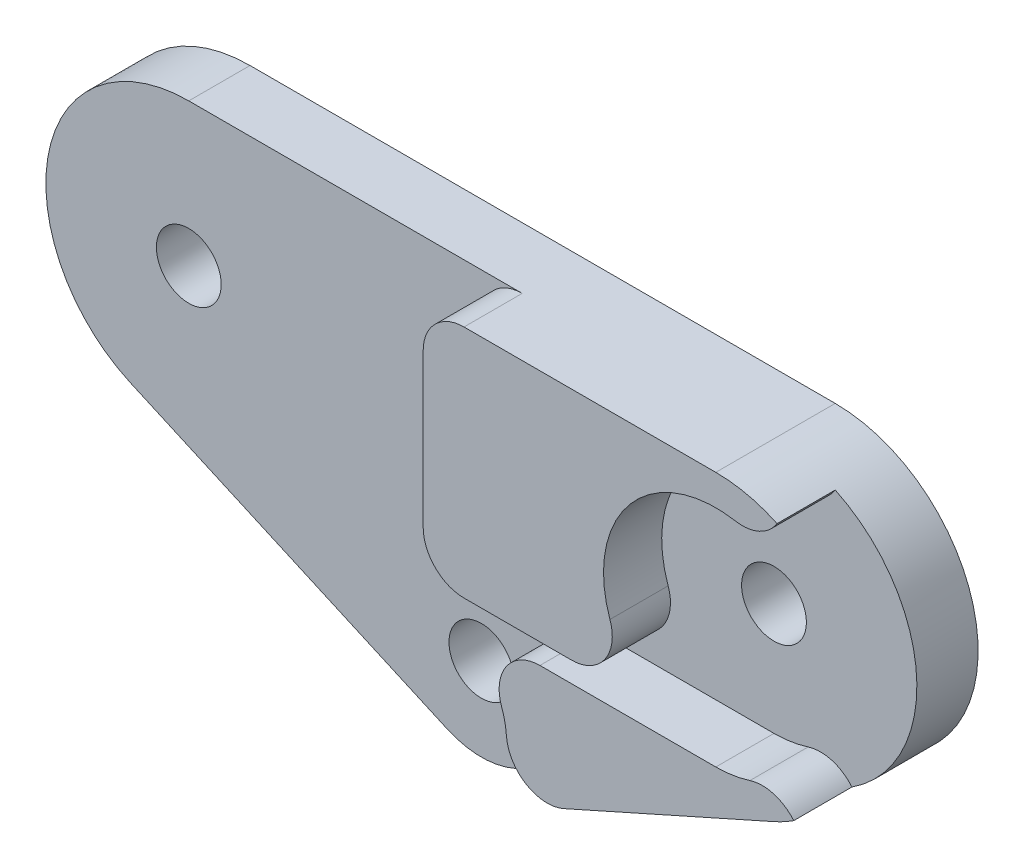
ISO-10303-21;
HEADER;
FILE_DESCRIPTION(('STEP AP214'),'2;1');
FILE_NAME('part.step','',(''),(''),'','','');
FILE_SCHEMA(('AUTOMOTIVE_DESIGN { 1 0 10303 214 1 1 1 1 }'));
ENDSEC;
DATA;
#1=APPLICATION_CONTEXT('core data for automotive mechanical design processes');
#2=APPLICATION_PROTOCOL_DEFINITION('international standard','automotive_design',2000,#1);
#3=PRODUCT_CONTEXT('',#1,'mechanical');
#4=PRODUCT('Part','Part','',(#3));
#5=PRODUCT_RELATED_PRODUCT_CATEGORY('part','',(#4));
#6=PRODUCT_DEFINITION_FORMATION('','',#4);
#7=PRODUCT_DEFINITION_CONTEXT('part definition',#1,'design');
#8=PRODUCT_DEFINITION('design','',#6,#7);
#9=PRODUCT_DEFINITION_SHAPE('','',#8);
#10=(LENGTH_UNIT() NAMED_UNIT(*) SI_UNIT(.MILLI.,.METRE.));
#11=(NAMED_UNIT(*) PLANE_ANGLE_UNIT() SI_UNIT($,.RADIAN.));
#12=(NAMED_UNIT(*) SI_UNIT($,.STERADIAN.) SOLID_ANGLE_UNIT());
#13=UNCERTAINTY_MEASURE_WITH_UNIT(LENGTH_MEASURE(1.E-05),#10,'distance_accuracy_value','');
#14=(GEOMETRIC_REPRESENTATION_CONTEXT(3) GLOBAL_UNCERTAINTY_ASSIGNED_CONTEXT((#13)) GLOBAL_UNIT_ASSIGNED_CONTEXT((#10,
#11,#12)) REPRESENTATION_CONTEXT('',''));
#15=CARTESIAN_POINT('',(0.,0.,0.));
#16=DIRECTION('',(0.,0.,1.));
#17=DIRECTION('',(1.,0.,0.));
#18=AXIS2_PLACEMENT_3D('',#15,#16,#17);
#19=CARTESIAN_POINT('',(-14.3333333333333,0.,3.));
#20=DIRECTION('',(0.,0.,1.));
#21=DIRECTION('',(1.,0.,0.));
#22=AXIS2_PLACEMENT_3D('',#19,#20,#21);
#23=PLANE('',#22);
#24=CARTESIAN_POINT('',(-14.3333333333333,0.,3.));
#25=DIRECTION('',(0.,0.,1.));
#26=DIRECTION('',(1.,0.,0.));
#27=AXIS2_PLACEMENT_3D('',#24,#25,#26);
#28=CIRCLE('',#27,1.5875);
#29=CARTESIAN_POINT('',(-12.7458333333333,0.,3.));
#30=VERTEX_POINT('',#29);
#31=EDGE_CURVE('E260',#30,#30,#28,.T.);
#32=ORIENTED_EDGE('',*,*,#31,.F.);
#33=EDGE_LOOP('',(#32));
#34=FACE_BOUND('',#33,.T.);
#35=CARTESIAN_POINT('',(14.3333333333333,0.,3.));
#36=DIRECTION('',(0.,0.,1.));
#37=DIRECTION('',(1.,0.,0.));
#38=AXIS2_PLACEMENT_3D('',#35,#36,#37);
#39=CIRCLE('',#38,1.5875);
#40=CARTESIAN_POINT('',(15.9208333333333,0.,3.));
#41=VERTEX_POINT('',#40);
#42=EDGE_CURVE('E253',#41,#41,#39,.T.);
#43=ORIENTED_EDGE('',*,*,#42,.F.);
#44=EDGE_LOOP('',(#43));
#45=FACE_BOUND('',#44,.T.);
#46=CARTESIAN_POINT('',(0.,-9.5875,3.));
#47=DIRECTION('',(0.,0.,1.));
#48=DIRECTION('',(1.,0.,0.));
#49=AXIS2_PLACEMENT_3D('',#46,#47,#48);
#50=CIRCLE('',#49,1.5875);
#51=CARTESIAN_POINT('',(1.5875,-9.5875,3.));
#52=VERTEX_POINT('',#51);
#53=EDGE_CURVE('E254',#52,#52,#50,.T.);
#54=ORIENTED_EDGE('',*,*,#53,.F.);
#55=EDGE_LOOP('',(#54));
#56=FACE_BOUND('',#55,.T.);
#57=DIRECTION('',(0.913156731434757,0.407608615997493,0.));
#58=VECTOR('',#57,1.);
#59=CARTESIAN_POINT('',(17.1865936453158,-6.39209712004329,3.));
#60=LINE('',#59,#58);
#61=CARTESIAN_POINT('',(1.66610021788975,-13.3200281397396,3.));
#62=VERTEX_POINT('',#61);
#63=CARTESIAN_POINT('',(6.88788780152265,-10.9891625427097,3.));
#64=VERTEX_POINT('',#63);
#65=EDGE_CURVE('E277',#62,#64,#60,.T.);
#66=ORIENTED_EDGE('',*,*,#65,.T.);
#67=CARTESIAN_POINT('',(6.07267056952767,-9.16284907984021,3.));
#68=DIRECTION('',(0.,0.,1.));
#69=DIRECTION('',(1.,0.,0.));
#70=AXIS2_PLACEMENT_3D('',#67,#68,#69);
#71=CIRCLE('',#70,2.);
#72=CARTESIAN_POINT('',(4.07754266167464,-9.30236478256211,3.));
#73=VERTEX_POINT('',#72);
#74=EDGE_CURVE('E345',#64,#73,#71,.F.);
#75=ORIENTED_EDGE('',*,*,#74,.T.);
#76=CARTESIAN_POINT('',(0.,-9.5875,3.));
#77=DIRECTION('',(0.,0.,1.));
#78=DIRECTION('',(1.,0.,0.));
#79=AXIS2_PLACEMENT_3D('',#76,#77,#78);
#80=CIRCLE('',#79,4.0875);
#81=CARTESIAN_POINT('',(3.83965910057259,-8.18583162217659,3.));
#82=VERTEX_POINT('',#81);
#83=EDGE_CURVE('E217',#82,#73,#80,.F.);
#84=ORIENTED_EDGE('',*,*,#83,.F.);
#85=CARTESIAN_POINT('',(5.71839138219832,-7.5,3.));
#86=DIRECTION('',(0.,0.,1.));
#87=DIRECTION('',(1.,0.,0.));
#88=AXIS2_PLACEMENT_3D('',#85,#86,#87);
#89=CIRCLE('',#88,2.);
#90=CARTESIAN_POINT('',(5.71839138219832,-5.5,3.));
#91=VERTEX_POINT('',#90);
#92=EDGE_CURVE('E46',#82,#91,#89,.F.);
#93=ORIENTED_EDGE('',*,*,#92,.T.);
#94=DIRECTION('',(1.,0.,0.));
#95=VECTOR('',#94,1.);
#96=CARTESIAN_POINT('',(0.,-5.5,3.));
#97=LINE('',#96,#95);
#98=CARTESIAN_POINT('',(14.3333333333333,-5.5,3.));
#99=VERTEX_POINT('',#98);
#100=EDGE_CURVE('E215',#91,#99,#97,.T.);
#101=ORIENTED_EDGE('',*,*,#100,.T.);
#102=CARTESIAN_POINT('',(14.3333333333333,0.,3.));
#103=DIRECTION('',(0.,0.,1.));
#104=DIRECTION('',(1.,0.,0.));
#105=AXIS2_PLACEMENT_3D('',#102,#103,#104);
#106=CIRCLE('',#105,5.5);
#107=CARTESIAN_POINT('',(16.0052266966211,-5.23973020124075,3.));
#108=VERTEX_POINT('',#107);
#109=EDGE_CURVE('E220',#99,#108,#106,.T.);
#110=ORIENTED_EDGE('',*,*,#109,.T.);
#111=CARTESIAN_POINT('',(16.6131879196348,-7.14508663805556,3.));
#112=DIRECTION('',(0.,0.,1.));
#113=DIRECTION('',(1.,0.,0.));
#114=AXIS2_PLACEMENT_3D('',#111,#112,#113);
#115=CIRCLE('',#114,2.);
#116=CARTESIAN_POINT('',(18.1515151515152,-5.86698283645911,3.));
#117=VERTEX_POINT('',#116);
#118=EDGE_CURVE('E337',#108,#117,#115,.F.);
#119=ORIENTED_EDGE('',*,*,#118,.T.);
#120=CARTESIAN_POINT('',(14.3333333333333,0.,3.));
#121=DIRECTION('',(0.,0.,1.));
#122=DIRECTION('',(-1.,0.,0.));
#123=AXIS2_PLACEMENT_3D('',#120,#121,#122);
#124=CIRCLE('',#123,7.);
#125=CARTESIAN_POINT('',(17.3333333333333,6.32455532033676,3.));
#126=VERTEX_POINT('',#125);
#127=EDGE_CURVE('E279',#117,#126,#124,.T.);
#128=ORIENTED_EDGE('',*,*,#127,.T.);
#129=CARTESIAN_POINT('',(15.6380211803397,7.38564754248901,3.));
#130=DIRECTION('',(0.,0.,1.));
#131=DIRECTION('',(1.,0.,0.));
#132=AXIS2_PLACEMENT_3D('',#129,#130,#131);
#133=CIRCLE('',#132,2.);
#134=CARTESIAN_POINT('',(15.290104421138,5.41614153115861,3.));
#135=VERTEX_POINT('',#134);
#136=EDGE_CURVE('E335',#126,#135,#133,.F.);
#137=ORIENTED_EDGE('',*,*,#136,.T.);
#138=CARTESIAN_POINT('',(14.3333333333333,0.,3.));
#139=DIRECTION('',(0.,0.,1.));
#140=DIRECTION('',(1.,0.,0.));
#141=AXIS2_PLACEMENT_3D('',#138,#139,#140);
#142=CIRCLE('',#141,5.5);
#143=CARTESIAN_POINT('',(9.14788360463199,-1.83333333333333,3.));
#144=VERTEX_POINT('',#143);
#145=EDGE_CURVE('E227',#135,#144,#142,.T.);
#146=ORIENTED_EDGE('',*,*,#145,.T.);
#147=CARTESIAN_POINT('',(7.26226552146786,-2.5,3.));
#148=DIRECTION('',(0.,0.,1.));
#149=DIRECTION('',(1.,0.,0.));
#150=AXIS2_PLACEMENT_3D('',#147,#148,#149);
#151=CIRCLE('',#150,2.);
#152=CARTESIAN_POINT('',(7.26226552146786,-4.5,3.));
#153=VERTEX_POINT('',#152);
#154=EDGE_CURVE('E343',#144,#153,#151,.F.);
#155=ORIENTED_EDGE('',*,*,#154,.T.);
#156=DIRECTION('',(1.,0.,0.));
#157=VECTOR('',#156,1.);
#158=CARTESIAN_POINT('',(0.,-4.5,3.));
#159=LINE('',#158,#157);
#160=CARTESIAN_POINT('',(2.,-4.5,3.));
#161=VERTEX_POINT('',#160);
#162=EDGE_CURVE('E232',#161,#153,#159,.T.);
#163=ORIENTED_EDGE('',*,*,#162,.F.);
#164=CARTESIAN_POINT('',(2.,-2.5,3.));
#165=DIRECTION('',(0.,0.,1.));
#166=DIRECTION('',(1.,0.,0.));
#167=AXIS2_PLACEMENT_3D('',#164,#165,#166);
#168=CIRCLE('',#167,2.);
#169=CARTESIAN_POINT('',(0.,-2.5,3.));
#170=VERTEX_POINT('',#169);
#171=EDGE_CURVE('E341',#161,#170,#168,.F.);
#172=ORIENTED_EDGE('',*,*,#171,.T.);
#173=DIRECTION('',(0.,-1.,0.));
#174=VECTOR('',#173,1.);
#175=CARTESIAN_POINT('',(0.,0.,3.));
#176=LINE('',#175,#174);
#177=CARTESIAN_POINT('',(0.,5.,3.));
#178=VERTEX_POINT('',#177);
#179=EDGE_CURVE('E247',#178,#170,#176,.T.);
#180=ORIENTED_EDGE('',*,*,#179,.F.);
#181=CARTESIAN_POINT('',(2.,5.,3.));
#182=DIRECTION('',(0.,0.,1.));
#183=DIRECTION('',(1.,0.,0.));
#184=AXIS2_PLACEMENT_3D('',#181,#182,#183);
#185=CIRCLE('',#184,2.);
#186=CARTESIAN_POINT('',(2.,7.,3.));
#187=VERTEX_POINT('',#186);
#188=EDGE_CURVE('E11',#178,#187,#185,.F.);
#189=ORIENTED_EDGE('',*,*,#188,.T.);
#190=DIRECTION('',(-1.,0.,0.));
#191=VECTOR('',#190,1.);
#192=CARTESIAN_POINT('',(-14.3333333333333,7.,3.));
#193=LINE('',#192,#191);
#194=CARTESIAN_POINT('',(-14.3333333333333,7.,3.));
#195=VERTEX_POINT('',#194);
#196=EDGE_CURVE('E53',#187,#195,#193,.T.);
#197=ORIENTED_EDGE('',*,*,#196,.T.);
#198=CARTESIAN_POINT('',(-14.3333333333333,0.,3.));
#199=DIRECTION('',(0.,0.,1.));
#200=DIRECTION('',(1.,0.,0.));
#201=AXIS2_PLACEMENT_3D('',#198,#199,#200);
#202=CIRCLE('',#201,7.);
#203=CARTESIAN_POINT('',(-17.1865936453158,-6.3920971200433,3.));
#204=VERTEX_POINT('',#203);
#205=EDGE_CURVE('E269',#195,#204,#202,.T.);
#206=ORIENTED_EDGE('',*,*,#205,.T.);
#207=DIRECTION('',(0.913156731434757,-0.407608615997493,0.));
#208=VECTOR('',#207,1.);
#209=CARTESIAN_POINT('',(-17.1865936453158,-6.3920971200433,3.));
#210=LINE('',#209,#208);
#211=CARTESIAN_POINT('',(-1.66610021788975,-13.3200281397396,3.));
#212=VERTEX_POINT('',#211);
#213=EDGE_CURVE('E272',#204,#212,#210,.T.);
#214=ORIENTED_EDGE('',*,*,#213,.T.);
#215=CARTESIAN_POINT('',(0.,-9.5875,3.));
#216=DIRECTION('',(0.,0.,1.));
#217=DIRECTION('',(1.,0.,0.));
#218=AXIS2_PLACEMENT_3D('',#215,#216,#217);
#219=CIRCLE('',#218,4.0875);
#220=EDGE_CURVE('E275',#212,#62,#219,.T.);
#221=ORIENTED_EDGE('',*,*,#220,.T.);
#222=EDGE_LOOP('',(#66,#75,#84,#93,#101,#110,#119,#128,#137,#146,#155,#163,#172,#180,#189,#197,
#206,#214,#221));
#223=FACE_BOUND('',#222,.T.);
#224=ADVANCED_FACE('F38',(#34,#45,#56,#223),#23,.T.);
#225=CARTESIAN_POINT('',(-14.3333333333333,0.,3.));
#226=DIRECTION('',(0.,0.,-1.));
#227=DIRECTION('',(-1.,0.,0.));
#228=AXIS2_PLACEMENT_3D('',#225,#226,#227);
#229=CYLINDRICAL_SURFACE('',#228,7.);
#230=CARTESIAN_POINT('',(-14.3333333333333,0.,0.));
#231=DIRECTION('',(0.,0.,1.));
#232=DIRECTION('',(1.,0.,0.));
#233=AXIS2_PLACEMENT_3D('',#230,#231,#232);
#234=CIRCLE('',#233,7.);
#235=CARTESIAN_POINT('',(-14.3333333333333,7.,0.));
#236=VERTEX_POINT('',#235);
#237=CARTESIAN_POINT('',(-17.1865936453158,-6.3920971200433,0.));
#238=VERTEX_POINT('',#237);
#239=EDGE_CURVE('E266',#236,#238,#234,.T.);
#240=ORIENTED_EDGE('',*,*,#239,.T.);
#241=DIRECTION('',(0.,0.,-1.));
#242=VECTOR('',#241,1.);
#243=CARTESIAN_POINT('',(-17.1865936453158,-6.3920971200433,3.));
#244=LINE('',#243,#242);
#245=EDGE_CURVE('E294',#204,#238,#244,.T.);
#246=ORIENTED_EDGE('',*,*,#245,.F.);
#247=ORIENTED_EDGE('',*,*,#205,.F.);
#248=DIRECTION('',(0.,0.,-1.));
#249=VECTOR('',#248,1.);
#250=CARTESIAN_POINT('',(-14.3333333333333,7.,3.));
#251=LINE('',#250,#249);
#252=EDGE_CURVE('E374',#195,#236,#251,.T.);
#253=ORIENTED_EDGE('',*,*,#252,.T.);
#254=EDGE_LOOP('',(#240,#246,#247,#253));
#255=FACE_BOUND('',#254,.T.);
#256=ADVANCED_FACE('F421',(#255),#229,.T.);
#257=CARTESIAN_POINT('',(-17.1865936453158,-6.3920971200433,3.));
#258=DIRECTION('',(0.407608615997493,0.913156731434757,0.));
#259=DIRECTION('',(-0.913156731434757,0.407608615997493,0.));
#260=AXIS2_PLACEMENT_3D('',#257,#258,#259);
#261=PLANE('',#260);
#262=DIRECTION('',(0.913156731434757,-0.407608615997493,0.));
#263=VECTOR('',#262,1.);
#264=CARTESIAN_POINT('',(-17.1865936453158,-6.3920971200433,0.));
#265=LINE('',#264,#263);
#266=CARTESIAN_POINT('',(-1.66610021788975,-13.3200281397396,0.));
#267=VERTEX_POINT('',#266);
#268=EDGE_CURVE('E369',#238,#267,#265,.T.);
#269=ORIENTED_EDGE('',*,*,#268,.T.);
#270=DIRECTION('',(0.,0.,-1.));
#271=VECTOR('',#270,1.);
#272=CARTESIAN_POINT('',(-1.66610021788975,-13.3200281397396,3.));
#273=LINE('',#272,#271);
#274=EDGE_CURVE('E358',#212,#267,#273,.T.);
#275=ORIENTED_EDGE('',*,*,#274,.F.);
#276=ORIENTED_EDGE('',*,*,#213,.F.);
#277=ORIENTED_EDGE('',*,*,#245,.T.);
#278=EDGE_LOOP('',(#269,#275,#276,#277));
#279=FACE_BOUND('',#278,.T.);
#280=ADVANCED_FACE('F427',(#279),#261,.F.);
#281=CARTESIAN_POINT('',(0.,-9.5875,3.));
#282=DIRECTION('',(0.,0.,-1.));
#283=DIRECTION('',(-1.,0.,0.));
#284=AXIS2_PLACEMENT_3D('',#281,#282,#283);
#285=CYLINDRICAL_SURFACE('',#284,4.0875);
#286=CARTESIAN_POINT('',(0.,-9.5875,0.));
#287=DIRECTION('',(0.,0.,1.));
#288=DIRECTION('',(1.,0.,0.));
#289=AXIS2_PLACEMENT_3D('',#286,#287,#288);
#290=CIRCLE('',#289,4.0875);
#291=CARTESIAN_POINT('',(1.66610021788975,-13.3200281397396,0.));
#292=VERTEX_POINT('',#291);
#293=EDGE_CURVE('E364',#267,#292,#290,.T.);
#294=ORIENTED_EDGE('',*,*,#293,.T.);
#295=DIRECTION('',(0.,0.,-1.));
#296=VECTOR('',#295,1.);
#297=CARTESIAN_POINT('',(1.66610021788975,-13.3200281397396,3.));
#298=LINE('',#297,#296);
#299=EDGE_CURVE('E200',#62,#292,#298,.T.);
#300=ORIENTED_EDGE('',*,*,#299,.F.);
#301=ORIENTED_EDGE('',*,*,#220,.F.);
#302=ORIENTED_EDGE('',*,*,#274,.T.);
#303=EDGE_LOOP('',(#294,#300,#301,#302));
#304=FACE_BOUND('',#303,.T.);
#305=ADVANCED_FACE('F446',(#304),#285,.T.);
#306=CARTESIAN_POINT('',(17.1865936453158,-6.39209712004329,3.));
#307=DIRECTION('',(-0.407608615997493,0.913156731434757,0.));
#308=DIRECTION('',(-0.913156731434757,-0.407608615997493,0.));
#309=AXIS2_PLACEMENT_3D('',#306,#307,#308);
#310=PLANE('',#309);
#311=DIRECTION('',(0.913156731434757,0.407608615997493,0.));
#312=VECTOR('',#311,1.);
#313=CARTESIAN_POINT('',(5.23466888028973,-11.7271150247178,5.85));
#314=LINE('',#313,#312);
#315=CARTESIAN_POINT('',(6.88788780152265,-10.9891625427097,5.85));
#316=VERTEX_POINT('',#315);
#317=CARTESIAN_POINT('',(17.1865936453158,-6.39209712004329,5.85));
#318=VERTEX_POINT('',#317);
#319=EDGE_CURVE('E178',#316,#318,#314,.T.);
#320=ORIENTED_EDGE('',*,*,#319,.F.);
#321=DIRECTION('',(0.,0.,-1.));
#322=VECTOR('',#321,1.);
#323=CARTESIAN_POINT('',(6.88788780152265,-10.9891625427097,3.));
#324=LINE('',#323,#322);
#325=EDGE_CURVE('E324',#316,#64,#324,.T.);
#326=ORIENTED_EDGE('',*,*,#325,.T.);
#327=ORIENTED_EDGE('',*,*,#65,.F.);
#328=ORIENTED_EDGE('',*,*,#299,.T.);
#329=DIRECTION('',(0.913156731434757,0.407608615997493,0.));
#330=VECTOR('',#329,1.);
#331=CARTESIAN_POINT('',(17.1865936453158,-6.39209712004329,0.));
#332=LINE('',#331,#330);
#333=CARTESIAN_POINT('',(17.1865936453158,-6.39209712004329,0.));
#334=VERTEX_POINT('',#333);
#335=EDGE_CURVE('E197',#292,#334,#332,.T.);
#336=ORIENTED_EDGE('',*,*,#335,.T.);
#337=DIRECTION('',(0.,0.,-1.));
#338=VECTOR('',#337,1.);
#339=CARTESIAN_POINT('',(17.1865936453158,-6.39209712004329,3.));
#340=LINE('',#339,#338);
#341=EDGE_CURVE('E193',#318,#334,#340,.T.);
#342=ORIENTED_EDGE('',*,*,#341,.F.);
#343=EDGE_LOOP('',(#320,#326,#327,#328,#336,#342));
#344=FACE_BOUND('',#343,.T.);
#345=ADVANCED_FACE('F194',(#344),#310,.F.);
#346=CARTESIAN_POINT('',(14.3333333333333,0.,3.));
#347=DIRECTION('',(0.,0.,-1.));
#348=DIRECTION('',(-1.,0.,0.));
#349=AXIS2_PLACEMENT_3D('',#346,#347,#348);
#350=CYLINDRICAL_SURFACE('',#349,7.);
#351=CARTESIAN_POINT('',(14.3333333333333,0.,0.));
#352=DIRECTION('',(0.,0.,1.));
#353=DIRECTION('',(-1.,0.,0.));
#354=AXIS2_PLACEMENT_3D('',#351,#352,#353);
#355=CIRCLE('',#354,7.);
#356=CARTESIAN_POINT('',(14.3333333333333,7.,0.));
#357=VERTEX_POINT('',#356);
#358=EDGE_CURVE('E366',#334,#357,#355,.T.);
#359=ORIENTED_EDGE('',*,*,#358,.T.);
#360=DIRECTION('',(0.,0.,-1.));
#361=VECTOR('',#360,1.);
#362=CARTESIAN_POINT('',(14.3333333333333,7.,3.));
#363=LINE('',#362,#361);
#364=CARTESIAN_POINT('',(14.3333333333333,7.,5.85));
#365=VERTEX_POINT('',#364);
#366=EDGE_CURVE('E201',#365,#357,#363,.T.);
#367=ORIENTED_EDGE('',*,*,#366,.F.);
#368=CARTESIAN_POINT('',(14.3333333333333,0.,5.85));
#369=DIRECTION('',(0.,0.,1.));
#370=DIRECTION('',(1.,0.,0.));
#371=AXIS2_PLACEMENT_3D('',#368,#369,#370);
#372=CIRCLE('',#371,7.);
#373=CARTESIAN_POINT('',(17.3333333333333,6.32455532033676,5.85));
#374=VERTEX_POINT('',#373);
#375=EDGE_CURVE('E231',#374,#365,#372,.T.);
#376=ORIENTED_EDGE('',*,*,#375,.F.);
#377=DIRECTION('',(0.,0.,-1.));
#378=VECTOR('',#377,1.);
#379=CARTESIAN_POINT('',(17.3333333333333,6.32455532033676,5.85));
#380=LINE('',#379,#378);
#381=EDGE_CURVE('E244',#374,#126,#380,.T.);
#382=ORIENTED_EDGE('',*,*,#381,.T.);
#383=ORIENTED_EDGE('',*,*,#127,.F.);
#384=DIRECTION('',(0.,0.,-1.));
#385=VECTOR('',#384,1.);
#386=CARTESIAN_POINT('',(18.1515151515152,-5.86698283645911,5.85));
#387=LINE('',#386,#385);
#388=CARTESIAN_POINT('',(18.1515151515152,-5.86698283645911,5.85));
#389=VERTEX_POINT('',#388);
#390=EDGE_CURVE('E206',#389,#117,#387,.T.);
#391=ORIENTED_EDGE('',*,*,#390,.F.);
#392=CARTESIAN_POINT('',(14.3333333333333,0.,5.85));
#393=DIRECTION('',(0.,0.,1.));
#394=DIRECTION('',(1.,0.,0.));
#395=AXIS2_PLACEMENT_3D('',#392,#393,#394);
#396=CIRCLE('',#395,7.);
#397=EDGE_CURVE('E182',#318,#389,#396,.T.);
#398=ORIENTED_EDGE('',*,*,#397,.F.);
#399=ORIENTED_EDGE('',*,*,#341,.T.);
#400=EDGE_LOOP('',(#359,#367,#376,#382,#383,#391,#398,#399));
#401=FACE_BOUND('',#400,.T.);
#402=ADVANCED_FACE('F203',(#401),#350,.T.);
#403=CARTESIAN_POINT('',(-14.3333333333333,7.,3.));
#404=DIRECTION('',(0.,-1.,0.));
#405=DIRECTION('',(1.,0.,0.));
#406=AXIS2_PLACEMENT_3D('',#403,#404,#405);
#407=PLANE('',#406);
#408=ORIENTED_EDGE('',*,*,#196,.F.);
#409=DIRECTION('',(0.,0.,-1.));
#410=VECTOR('',#409,1.);
#411=CARTESIAN_POINT('',(2.,7.,3.));
#412=LINE('',#411,#410);
#413=CARTESIAN_POINT('',(2.,7.,5.85));
#414=VERTEX_POINT('',#413);
#415=EDGE_CURVE('E333',#187,#414,#412,.F.);
#416=ORIENTED_EDGE('',*,*,#415,.T.);
#417=DIRECTION('',(-1.,0.,0.));
#418=VECTOR('',#417,1.);
#419=CARTESIAN_POINT('',(0.,7.,5.85));
#420=LINE('',#419,#418);
#421=EDGE_CURVE('E235',#365,#414,#420,.T.);
#422=ORIENTED_EDGE('',*,*,#421,.F.);
#423=ORIENTED_EDGE('',*,*,#366,.T.);
#424=DIRECTION('',(-1.,0.,0.));
#425=VECTOR('',#424,1.);
#426=CARTESIAN_POINT('',(-14.3333333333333,7.,0.));
#427=LINE('',#426,#425);
#428=EDGE_CURVE('E273',#357,#236,#427,.T.);
#429=ORIENTED_EDGE('',*,*,#428,.T.);
#430=ORIENTED_EDGE('',*,*,#252,.F.);
#431=EDGE_LOOP('',(#408,#416,#422,#423,#429,#430));
#432=FACE_BOUND('',#431,.T.);
#433=ADVANCED_FACE('F438',(#432),#407,.F.);
#434=CARTESIAN_POINT('',(-14.3333333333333,0.,0.));
#435=DIRECTION('',(0.,0.,1.));
#436=DIRECTION('',(1.,0.,0.));
#437=AXIS2_PLACEMENT_3D('',#434,#435,#436);
#438=PLANE('',#437);
#439=CARTESIAN_POINT('',(0.,-9.5875,0.));
#440=DIRECTION('',(0.,0.,1.));
#441=DIRECTION('',(1.,0.,0.));
#442=AXIS2_PLACEMENT_3D('',#439,#440,#441);
#443=CIRCLE('',#442,1.5875);
#444=CARTESIAN_POINT('',(1.5875,-9.5875,0.));
#445=VERTEX_POINT('',#444);
#446=EDGE_CURVE('E250',#445,#445,#443,.T.);
#447=ORIENTED_EDGE('',*,*,#446,.T.);
#448=EDGE_LOOP('',(#447));
#449=FACE_BOUND('',#448,.T.);
#450=CARTESIAN_POINT('',(14.3333333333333,0.,0.));
#451=DIRECTION('',(0.,0.,1.));
#452=DIRECTION('',(1.,0.,0.));
#453=AXIS2_PLACEMENT_3D('',#450,#451,#452);
#454=CIRCLE('',#453,1.5875);
#455=CARTESIAN_POINT('',(15.9208333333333,0.,0.));
#456=VERTEX_POINT('',#455);
#457=EDGE_CURVE('E257',#456,#456,#454,.T.);
#458=ORIENTED_EDGE('',*,*,#457,.T.);
#459=EDGE_LOOP('',(#458));
#460=FACE_BOUND('',#459,.T.);
#461=CARTESIAN_POINT('',(-14.3333333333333,0.,0.));
#462=DIRECTION('',(0.,0.,1.));
#463=DIRECTION('',(1.,0.,0.));
#464=AXIS2_PLACEMENT_3D('',#461,#462,#463);
#465=CIRCLE('',#464,1.5875);
#466=CARTESIAN_POINT('',(-12.7458333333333,0.,0.));
#467=VERTEX_POINT('',#466);
#468=EDGE_CURVE('E263',#467,#467,#465,.T.);
#469=ORIENTED_EDGE('',*,*,#468,.T.);
#470=EDGE_LOOP('',(#469));
#471=FACE_BOUND('',#470,.T.);
#472=ORIENTED_EDGE('',*,*,#239,.F.);
#473=ORIENTED_EDGE('',*,*,#428,.F.);
#474=ORIENTED_EDGE('',*,*,#358,.F.);
#475=ORIENTED_EDGE('',*,*,#335,.F.);
#476=ORIENTED_EDGE('',*,*,#293,.F.);
#477=ORIENTED_EDGE('',*,*,#268,.F.);
#478=EDGE_LOOP('',(#472,#473,#474,#475,#476,#477));
#479=FACE_BOUND('',#478,.T.);
#480=ADVANCED_FACE('F363',(#449,#460,#471,#479),#438,.F.);
#481=CARTESIAN_POINT('',(-14.3333333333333,0.,0.));
#482=DIRECTION('',(0.,0.,1.));
#483=DIRECTION('',(1.,0.,0.));
#484=AXIS2_PLACEMENT_3D('',#481,#482,#483);
#485=CYLINDRICAL_SURFACE('',#484,1.5875);
#486=ORIENTED_EDGE('',*,*,#468,.F.);
#487=EDGE_LOOP('',(#486));
#488=FACE_BOUND('',#487,.T.);
#489=ORIENTED_EDGE('',*,*,#31,.T.);
#490=EDGE_LOOP('',(#489));
#491=FACE_BOUND('',#490,.T.);
#492=ADVANCED_FACE('F434',(#488,#491),#485,.F.);
#493=CARTESIAN_POINT('',(14.3333333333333,0.,0.));
#494=DIRECTION('',(0.,0.,1.));
#495=DIRECTION('',(1.,0.,0.));
#496=AXIS2_PLACEMENT_3D('',#493,#494,#495);
#497=CYLINDRICAL_SURFACE('',#496,1.5875);
#498=ORIENTED_EDGE('',*,*,#457,.F.);
#499=EDGE_LOOP('',(#498));
#500=FACE_BOUND('',#499,.T.);
#501=ORIENTED_EDGE('',*,*,#42,.T.);
#502=EDGE_LOOP('',(#501));
#503=FACE_BOUND('',#502,.T.);
#504=ADVANCED_FACE('F504',(#500,#503),#497,.F.);
#505=CARTESIAN_POINT('',(0.,-9.5875,0.));
#506=DIRECTION('',(0.,0.,1.));
#507=DIRECTION('',(1.,0.,0.));
#508=AXIS2_PLACEMENT_3D('',#505,#506,#507);
#509=CYLINDRICAL_SURFACE('',#508,1.5875);
#510=ORIENTED_EDGE('',*,*,#446,.F.);
#511=EDGE_LOOP('',(#510));
#512=FACE_BOUND('',#511,.T.);
#513=ORIENTED_EDGE('',*,*,#53,.T.);
#514=EDGE_LOOP('',(#513));
#515=FACE_BOUND('',#514,.T.);
#516=ADVANCED_FACE('F497',(#512,#515),#509,.F.);
#517=CARTESIAN_POINT('',(14.3333333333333,0.,5.85));
#518=DIRECTION('',(0.,0.,-1.));
#519=DIRECTION('',(-1.,0.,0.));
#520=AXIS2_PLACEMENT_3D('',#517,#518,#519);
#521=CYLINDRICAL_SURFACE('',#520,5.5);
#522=ORIENTED_EDGE('',*,*,#145,.F.);
#523=DIRECTION('',(0.,0.,-1.));
#524=VECTOR('',#523,1.);
#525=CARTESIAN_POINT('',(15.290104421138,5.41614153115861,5.85));
#526=LINE('',#525,#524);
#527=CARTESIAN_POINT('',(15.290104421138,5.41614153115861,5.85));
#528=VERTEX_POINT('',#527);
#529=EDGE_CURVE('E293',#135,#528,#526,.F.);
#530=ORIENTED_EDGE('',*,*,#529,.T.);
#531=CARTESIAN_POINT('',(14.3333333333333,0.,5.85));
#532=DIRECTION('',(0.,0.,1.));
#533=DIRECTION('',(1.,0.,0.));
#534=AXIS2_PLACEMENT_3D('',#531,#532,#533);
#535=CIRCLE('',#534,5.5);
#536=CARTESIAN_POINT('',(9.14788360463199,-1.83333333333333,5.85));
#537=VERTEX_POINT('',#536);
#538=EDGE_CURVE('E228',#528,#537,#535,.T.);
#539=ORIENTED_EDGE('',*,*,#538,.T.);
#540=DIRECTION('',(0.,0.,-1.));
#541=VECTOR('',#540,1.);
#542=CARTESIAN_POINT('',(9.14788360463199,-1.83333333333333,5.85));
#543=LINE('',#542,#541);
#544=EDGE_CURVE('E290',#537,#144,#543,.T.);
#545=ORIENTED_EDGE('',*,*,#544,.T.);
#546=EDGE_LOOP('',(#522,#530,#539,#545));
#547=FACE_BOUND('',#546,.T.);
#548=ADVANCED_FACE('F491',(#547),#521,.F.);
#549=CARTESIAN_POINT('',(0.,0.,5.85));
#550=DIRECTION('',(1.,0.,0.));
#551=DIRECTION('',(0.,1.,0.));
#552=AXIS2_PLACEMENT_3D('',#549,#550,#551);
#553=PLANE('',#552);
#554=ORIENTED_EDGE('',*,*,#179,.T.);
#555=DIRECTION('',(0.,0.,-1.));
#556=VECTOR('',#555,1.);
#557=CARTESIAN_POINT('',(0.,-2.5,5.85));
#558=LINE('',#557,#556);
#559=CARTESIAN_POINT('',(0.,-2.5,5.85));
#560=VERTEX_POINT('',#559);
#561=EDGE_CURVE('E322',#170,#560,#558,.F.);
#562=ORIENTED_EDGE('',*,*,#561,.T.);
#563=DIRECTION('',(0.,-1.,0.));
#564=VECTOR('',#563,1.);
#565=CARTESIAN_POINT('',(0.,0.,5.85));
#566=LINE('',#565,#564);
#567=CARTESIAN_POINT('',(0.,5.,5.85));
#568=VERTEX_POINT('',#567);
#569=EDGE_CURVE('E238',#568,#560,#566,.T.);
#570=ORIENTED_EDGE('',*,*,#569,.F.);
#571=DIRECTION('',(0.,0.,-1.));
#572=VECTOR('',#571,1.);
#573=CARTESIAN_POINT('',(0.,5.,5.85));
#574=LINE('',#573,#572);
#575=EDGE_CURVE('E317',#568,#178,#574,.T.);
#576=ORIENTED_EDGE('',*,*,#575,.T.);
#577=EDGE_LOOP('',(#554,#562,#570,#576));
#578=FACE_BOUND('',#577,.T.);
#579=ADVANCED_FACE('F480',(#578),#553,.F.);
#580=CARTESIAN_POINT('',(0.,-4.5,5.85));
#581=DIRECTION('',(0.,1.,0.));
#582=DIRECTION('',(-1.,0.,0.));
#583=AXIS2_PLACEMENT_3D('',#580,#581,#582);
#584=PLANE('',#583);
#585=DIRECTION('',(1.,0.,0.));
#586=VECTOR('',#585,1.);
#587=CARTESIAN_POINT('',(0.,-4.5,5.85));
#588=LINE('',#587,#586);
#589=CARTESIAN_POINT('',(2.,-4.5,5.85));
#590=VERTEX_POINT('',#589);
#591=CARTESIAN_POINT('',(7.26226552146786,-4.5,5.85));
#592=VERTEX_POINT('',#591);
#593=EDGE_CURVE('E241',#590,#592,#588,.T.);
#594=ORIENTED_EDGE('',*,*,#593,.F.);
#595=DIRECTION('',(0.,0.,-1.));
#596=VECTOR('',#595,1.);
#597=CARTESIAN_POINT('',(2.,-4.5,5.85));
#598=LINE('',#597,#596);
#599=EDGE_CURVE('E314',#590,#161,#598,.T.);
#600=ORIENTED_EDGE('',*,*,#599,.T.);
#601=ORIENTED_EDGE('',*,*,#162,.T.);
#602=DIRECTION('',(0.,0.,1.));
#603=VECTOR('',#602,1.);
#604=CARTESIAN_POINT('',(7.26226552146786,-4.5,5.85));
#605=LINE('',#604,#603);
#606=EDGE_CURVE('E312',#153,#592,#605,.T.);
#607=ORIENTED_EDGE('',*,*,#606,.T.);
#608=EDGE_LOOP('',(#594,#600,#601,#607));
#609=FACE_BOUND('',#608,.T.);
#610=ADVANCED_FACE('F417',(#609),#584,.F.);
#611=CARTESIAN_POINT('',(0.,0.,5.85));
#612=DIRECTION('',(0.,0.,1.));
#613=DIRECTION('',(1.,0.,0.));
#614=AXIS2_PLACEMENT_3D('',#611,#612,#613);
#615=PLANE('',#614);
#616=ORIENTED_EDGE('',*,*,#538,.F.);
#617=CARTESIAN_POINT('',(15.6380211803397,7.38564754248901,5.85));
#618=DIRECTION('',(0.,0.,1.));
#619=DIRECTION('',(1.,0.,0.));
#620=AXIS2_PLACEMENT_3D('',#617,#618,#619);
#621=CIRCLE('',#620,2.);
#622=EDGE_CURVE('E302',#528,#374,#621,.T.);
#623=ORIENTED_EDGE('',*,*,#622,.T.);
#624=ORIENTED_EDGE('',*,*,#375,.T.);
#625=ORIENTED_EDGE('',*,*,#421,.T.);
#626=CARTESIAN_POINT('',(2.,5.,5.85));
#627=DIRECTION('',(0.,0.,1.));
#628=DIRECTION('',(1.,0.,0.));
#629=AXIS2_PLACEMENT_3D('',#626,#627,#628);
#630=CIRCLE('',#629,2.);
#631=EDGE_CURVE('E296',#414,#568,#630,.T.);
#632=ORIENTED_EDGE('',*,*,#631,.T.);
#633=ORIENTED_EDGE('',*,*,#569,.T.);
#634=CARTESIAN_POINT('',(2.,-2.5,5.85));
#635=DIRECTION('',(0.,0.,1.));
#636=DIRECTION('',(1.,0.,0.));
#637=AXIS2_PLACEMENT_3D('',#634,#635,#636);
#638=CIRCLE('',#637,2.);
#639=EDGE_CURVE('E300',#560,#590,#638,.T.);
#640=ORIENTED_EDGE('',*,*,#639,.T.);
#641=ORIENTED_EDGE('',*,*,#593,.T.);
#642=CARTESIAN_POINT('',(7.26226552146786,-2.5,5.85));
#643=DIRECTION('',(0.,0.,1.));
#644=DIRECTION('',(1.,0.,0.));
#645=AXIS2_PLACEMENT_3D('',#642,#643,#644);
#646=CIRCLE('',#645,2.);
#647=EDGE_CURVE('E298',#592,#537,#646,.T.);
#648=ORIENTED_EDGE('',*,*,#647,.T.);
#649=EDGE_LOOP('',(#616,#623,#624,#625,#632,#633,#640,#641,#648));
#650=FACE_BOUND('',#649,.T.);
#651=ADVANCED_FACE('F410',(#650),#615,.T.);
#652=CARTESIAN_POINT('',(0.,-5.5,5.85));
#653=DIRECTION('',(0.,1.,0.));
#654=DIRECTION('',(-1.,0.,0.));
#655=AXIS2_PLACEMENT_3D('',#652,#653,#654);
#656=PLANE('',#655);
#657=ORIENTED_EDGE('',*,*,#100,.F.);
#658=DIRECTION('',(0.,0.,1.));
#659=VECTOR('',#658,1.);
#660=CARTESIAN_POINT('',(5.71839138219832,-5.5,5.85));
#661=LINE('',#660,#659);
#662=CARTESIAN_POINT('',(5.71839138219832,-5.5,5.85));
#663=VERTEX_POINT('',#662);
#664=EDGE_CURVE('E331',#91,#663,#661,.T.);
#665=ORIENTED_EDGE('',*,*,#664,.T.);
#666=DIRECTION('',(1.,0.,0.));
#667=VECTOR('',#666,1.);
#668=CARTESIAN_POINT('',(0.,-5.5,5.85));
#669=LINE('',#668,#667);
#670=CARTESIAN_POINT('',(14.3333333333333,-5.5,5.85));
#671=VERTEX_POINT('',#670);
#672=EDGE_CURVE('E223',#663,#671,#669,.T.);
#673=ORIENTED_EDGE('',*,*,#672,.T.);
#674=DIRECTION('',(0.,0.,-1.));
#675=VECTOR('',#674,1.);
#676=CARTESIAN_POINT('',(14.3333333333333,-5.5,5.85));
#677=LINE('',#676,#675);
#678=EDGE_CURVE('E211',#671,#99,#677,.T.);
#679=ORIENTED_EDGE('',*,*,#678,.T.);
#680=EDGE_LOOP('',(#657,#665,#673,#679));
#681=FACE_BOUND('',#680,.T.);
#682=ADVANCED_FACE('F408',(#681),#656,.T.);
#683=CARTESIAN_POINT('',(0.,-9.5875,5.85));
#684=DIRECTION('',(0.,0.,-1.));
#685=DIRECTION('',(-1.,0.,0.));
#686=AXIS2_PLACEMENT_3D('',#683,#684,#685);
#687=CYLINDRICAL_SURFACE('',#686,4.0875);
#688=ORIENTED_EDGE('',*,*,#83,.T.);
#689=DIRECTION('',(0.,0.,-1.));
#690=VECTOR('',#689,1.);
#691=CARTESIAN_POINT('',(4.07754266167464,-9.30236478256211,5.85));
#692=LINE('',#691,#690);
#693=CARTESIAN_POINT('',(4.07754266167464,-9.30236478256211,5.85));
#694=VERTEX_POINT('',#693);
#695=EDGE_CURVE('E329',#73,#694,#692,.F.);
#696=ORIENTED_EDGE('',*,*,#695,.T.);
#697=CARTESIAN_POINT('',(0.,-9.5875,5.85));
#698=DIRECTION('',(0.,0.,1.));
#699=DIRECTION('',(1.,0.,0.));
#700=AXIS2_PLACEMENT_3D('',#697,#698,#699);
#701=CIRCLE('',#700,4.0875);
#702=CARTESIAN_POINT('',(3.83965910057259,-8.18583162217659,5.85));
#703=VERTEX_POINT('',#702);
#704=EDGE_CURVE('E190',#703,#694,#701,.F.);
#705=ORIENTED_EDGE('',*,*,#704,.F.);
#706=DIRECTION('',(0.,0.,-1.));
#707=VECTOR('',#706,1.);
#708=CARTESIAN_POINT('',(3.83965910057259,-8.18583162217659,5.85));
#709=LINE('',#708,#707);
#710=EDGE_CURVE('E326',#703,#82,#709,.T.);
#711=ORIENTED_EDGE('',*,*,#710,.T.);
#712=EDGE_LOOP('',(#688,#696,#705,#711));
#713=FACE_BOUND('',#712,.T.);
#714=ADVANCED_FACE('F351',(#713),#687,.F.);
#715=CARTESIAN_POINT('',(14.3333333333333,0.,5.85));
#716=DIRECTION('',(0.,0.,-1.));
#717=DIRECTION('',(-1.,0.,0.));
#718=AXIS2_PLACEMENT_3D('',#715,#716,#717);
#719=CYLINDRICAL_SURFACE('',#718,5.5);
#720=CARTESIAN_POINT('',(14.3333333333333,0.,5.85));
#721=DIRECTION('',(0.,0.,1.));
#722=DIRECTION('',(1.,0.,0.));
#723=AXIS2_PLACEMENT_3D('',#720,#721,#722);
#724=CIRCLE('',#723,5.5);
#725=CARTESIAN_POINT('',(16.0052266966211,-5.23973020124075,5.85));
#726=VERTEX_POINT('',#725);
#727=EDGE_CURVE('E208',#671,#726,#724,.T.);
#728=ORIENTED_EDGE('',*,*,#727,.T.);
#729=DIRECTION('',(0.,0.,-1.));
#730=VECTOR('',#729,1.);
#731=CARTESIAN_POINT('',(16.0052266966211,-5.23973020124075,5.85));
#732=LINE('',#731,#730);
#733=EDGE_CURVE('E304',#726,#108,#732,.T.);
#734=ORIENTED_EDGE('',*,*,#733,.T.);
#735=ORIENTED_EDGE('',*,*,#109,.F.);
#736=ORIENTED_EDGE('',*,*,#678,.F.);
#737=EDGE_LOOP('',(#728,#734,#735,#736));
#738=FACE_BOUND('',#737,.T.);
#739=ADVANCED_FACE('F398',(#738),#719,.F.);
#740=CARTESIAN_POINT('',(0.,0.,5.85));
#741=DIRECTION('',(0.,0.,1.));
#742=DIRECTION('',(1.,0.,0.));
#743=AXIS2_PLACEMENT_3D('',#740,#741,#742);
#744=PLANE('',#743);
#745=ORIENTED_EDGE('',*,*,#397,.T.);
#746=CARTESIAN_POINT('',(16.6131879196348,-7.14508663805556,5.85));
#747=DIRECTION('',(0.,0.,1.));
#748=DIRECTION('',(1.,0.,0.));
#749=AXIS2_PLACEMENT_3D('',#746,#747,#748);
#750=CIRCLE('',#749,2.);
#751=EDGE_CURVE('E310',#389,#726,#750,.T.);
#752=ORIENTED_EDGE('',*,*,#751,.T.);
#753=ORIENTED_EDGE('',*,*,#727,.F.);
#754=ORIENTED_EDGE('',*,*,#672,.F.);
#755=CARTESIAN_POINT('',(5.71839138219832,-7.5,5.85));
#756=DIRECTION('',(0.,0.,1.));
#757=DIRECTION('',(1.,0.,0.));
#758=AXIS2_PLACEMENT_3D('',#755,#756,#757);
#759=CIRCLE('',#758,2.);
#760=EDGE_CURVE('E307',#663,#703,#759,.T.);
#761=ORIENTED_EDGE('',*,*,#760,.T.);
#762=ORIENTED_EDGE('',*,*,#704,.T.);
#763=CARTESIAN_POINT('',(6.07267056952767,-9.16284907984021,5.85));
#764=DIRECTION('',(0.,0.,1.));
#765=DIRECTION('',(1.,0.,0.));
#766=AXIS2_PLACEMENT_3D('',#763,#764,#765);
#767=CIRCLE('',#766,2.);
#768=EDGE_CURVE('E186',#694,#316,#767,.T.);
#769=ORIENTED_EDGE('',*,*,#768,.T.);
#770=ORIENTED_EDGE('',*,*,#319,.T.);
#771=EDGE_LOOP('',(#745,#752,#753,#754,#761,#762,#769,#770));
#772=FACE_BOUND('',#771,.T.);
#773=ADVANCED_FACE('F180',(#772),#744,.T.);
#774=CARTESIAN_POINT('',(15.6380211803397,7.38564754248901,5.85));
#775=DIRECTION('',(0.,0.,-1.));
#776=DIRECTION('',(-1.,0.,0.));
#777=AXIS2_PLACEMENT_3D('',#774,#775,#776);
#778=CYLINDRICAL_SURFACE('',#777,2.);
#779=ORIENTED_EDGE('',*,*,#622,.F.);
#780=ORIENTED_EDGE('',*,*,#529,.F.);
#781=ORIENTED_EDGE('',*,*,#136,.F.);
#782=ORIENTED_EDGE('',*,*,#381,.F.);
#783=EDGE_LOOP('',(#779,#780,#781,#782));
#784=FACE_BOUND('',#783,.T.);
#785=ADVANCED_FACE('F390',(#784),#778,.T.);
#786=CARTESIAN_POINT('',(16.6131879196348,-7.14508663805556,3.));
#787=DIRECTION('',(0.,0.,-1.));
#788=DIRECTION('',(-1.,0.,0.));
#789=AXIS2_PLACEMENT_3D('',#786,#787,#788);
#790=CYLINDRICAL_SURFACE('',#789,2.);
#791=ORIENTED_EDGE('',*,*,#751,.F.);
#792=ORIENTED_EDGE('',*,*,#390,.T.);
#793=ORIENTED_EDGE('',*,*,#118,.F.);
#794=ORIENTED_EDGE('',*,*,#733,.F.);
#795=EDGE_LOOP('',(#791,#792,#793,#794));
#796=FACE_BOUND('',#795,.T.);
#797=ADVANCED_FACE('F396',(#796),#790,.T.);
#798=CARTESIAN_POINT('',(2.,-2.5,5.85));
#799=DIRECTION('',(0.,0.,-1.));
#800=DIRECTION('',(-1.,0.,0.));
#801=AXIS2_PLACEMENT_3D('',#798,#799,#800);
#802=CYLINDRICAL_SURFACE('',#801,2.);
#803=ORIENTED_EDGE('',*,*,#639,.F.);
#804=ORIENTED_EDGE('',*,*,#561,.F.);
#805=ORIENTED_EDGE('',*,*,#171,.F.);
#806=ORIENTED_EDGE('',*,*,#599,.F.);
#807=EDGE_LOOP('',(#803,#804,#805,#806));
#808=FACE_BOUND('',#807,.T.);
#809=ADVANCED_FACE('F456',(#808),#802,.T.);
#810=CARTESIAN_POINT('',(7.26226552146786,-2.5,5.85));
#811=DIRECTION('',(0.,0.,-1.));
#812=DIRECTION('',(-1.,0.,0.));
#813=AXIS2_PLACEMENT_3D('',#810,#811,#812);
#814=CYLINDRICAL_SURFACE('',#813,2.);
#815=ORIENTED_EDGE('',*,*,#647,.F.);
#816=ORIENTED_EDGE('',*,*,#606,.F.);
#817=ORIENTED_EDGE('',*,*,#154,.F.);
#818=ORIENTED_EDGE('',*,*,#544,.F.);
#819=EDGE_LOOP('',(#815,#816,#817,#818));
#820=FACE_BOUND('',#819,.T.);
#821=ADVANCED_FACE('F459',(#820),#814,.T.);
#822=CARTESIAN_POINT('',(6.07267056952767,-9.16284907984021,5.85));
#823=DIRECTION('',(0.,0.,-1.));
#824=DIRECTION('',(-1.,0.,0.));
#825=AXIS2_PLACEMENT_3D('',#822,#823,#824);
#826=CYLINDRICAL_SURFACE('',#825,2.);
#827=ORIENTED_EDGE('',*,*,#768,.F.);
#828=ORIENTED_EDGE('',*,*,#695,.F.);
#829=ORIENTED_EDGE('',*,*,#74,.F.);
#830=ORIENTED_EDGE('',*,*,#325,.F.);
#831=EDGE_LOOP('',(#827,#828,#829,#830));
#832=FACE_BOUND('',#831,.T.);
#833=ADVANCED_FACE('F354',(#832),#826,.T.);
#834=CARTESIAN_POINT('',(5.71839138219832,-7.5,5.85));
#835=DIRECTION('',(0.,0.,-1.));
#836=DIRECTION('',(-1.,0.,0.));
#837=AXIS2_PLACEMENT_3D('',#834,#835,#836);
#838=CYLINDRICAL_SURFACE('',#837,2.);
#839=ORIENTED_EDGE('',*,*,#760,.F.);
#840=ORIENTED_EDGE('',*,*,#664,.F.);
#841=ORIENTED_EDGE('',*,*,#92,.F.);
#842=ORIENTED_EDGE('',*,*,#710,.F.);
#843=EDGE_LOOP('',(#839,#840,#841,#842));
#844=FACE_BOUND('',#843,.T.);
#845=ADVANCED_FACE('F407',(#844),#838,.T.);
#846=CARTESIAN_POINT('',(2.,5.,5.85));
#847=DIRECTION('',(0.,0.,-1.));
#848=DIRECTION('',(-1.,0.,0.));
#849=AXIS2_PLACEMENT_3D('',#846,#847,#848);
#850=CYLINDRICAL_SURFACE('',#849,2.);
#851=ORIENTED_EDGE('',*,*,#631,.F.);
#852=ORIENTED_EDGE('',*,*,#415,.F.);
#853=ORIENTED_EDGE('',*,*,#188,.F.);
#854=ORIENTED_EDGE('',*,*,#575,.F.);
#855=EDGE_LOOP('',(#851,#852,#853,#854));
#856=FACE_BOUND('',#855,.T.);
#857=ADVANCED_FACE('F40',(#856),#850,.T.);
#858=CLOSED_SHELL('',(#224,#256,#280,#305,#345,#402,#433,#480,#492,#504,#516,#548,#579,#610,
#651,#682,#714,#739,#773,#785,#797,#809,#821,#833,#845,#857));
#859=MANIFOLD_SOLID_BREP('B2',#858);
#860=ADVANCED_BREP_SHAPE_REPRESENTATION('',(#18,#859),#14);
#861=SHAPE_DEFINITION_REPRESENTATION(#9,#860);
ENDSEC;
END-ISO-10303-21;
